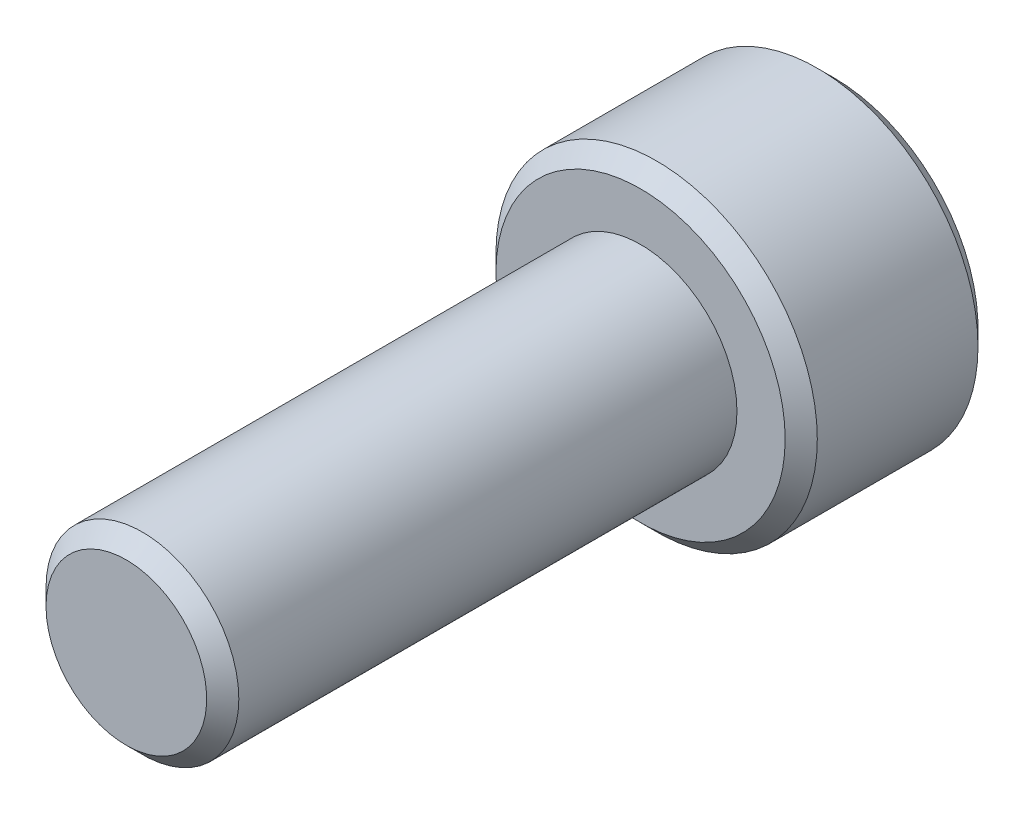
ISO-10303-21;
HEADER;
FILE_DESCRIPTION(('STEP AP214'),'2;1');
FILE_NAME('part.step','',(''),(''),'','','');
FILE_SCHEMA(('AUTOMOTIVE_DESIGN { 1 0 10303 214 1 1 1 1 }'));
ENDSEC;
DATA;
#1=APPLICATION_CONTEXT('core data for automotive mechanical design processes');
#2=APPLICATION_PROTOCOL_DEFINITION('international standard','automotive_design',2000,#1);
#3=PRODUCT_CONTEXT('',#1,'mechanical');
#4=PRODUCT('Part','Part','',(#3));
#5=PRODUCT_RELATED_PRODUCT_CATEGORY('part','',(#4));
#6=PRODUCT_DEFINITION_FORMATION('','',#4);
#7=PRODUCT_DEFINITION_CONTEXT('part definition',#1,'design');
#8=PRODUCT_DEFINITION('design','',#6,#7);
#9=PRODUCT_DEFINITION_SHAPE('','',#8);
#10=(LENGTH_UNIT() NAMED_UNIT(*) SI_UNIT(.MILLI.,.METRE.));
#11=(NAMED_UNIT(*) PLANE_ANGLE_UNIT() SI_UNIT($,.RADIAN.));
#12=(NAMED_UNIT(*) SI_UNIT($,.STERADIAN.) SOLID_ANGLE_UNIT());
#13=UNCERTAINTY_MEASURE_WITH_UNIT(LENGTH_MEASURE(1.E-05),#10,'distance_accuracy_value','');
#14=(GEOMETRIC_REPRESENTATION_CONTEXT(3) GLOBAL_UNCERTAINTY_ASSIGNED_CONTEXT((#13)) GLOBAL_UNIT_ASSIGNED_CONTEXT((#10,
#11,#12)) REPRESENTATION_CONTEXT('',''));
#15=CARTESIAN_POINT('',(0.,0.,0.));
#16=DIRECTION('',(0.,0.,1.));
#17=DIRECTION('',(1.,0.,0.));
#18=AXIS2_PLACEMENT_3D('',#15,#16,#17);
#19=CARTESIAN_POINT('',(-2.5,-1.443375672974,-22.25));
#20=DIRECTION('',(-1.,0.,0.));
#21=DIRECTION('',(0.,0.,1.));
#22=AXIS2_PLACEMENT_3D('',#19,#20,#21);
#23=PLANE('',#22);
#24=DIRECTION('',(0.,1.,0.));
#25=VECTOR('',#24,1.);
#26=CARTESIAN_POINT('',(-2.5,0.,-22.25));
#27=LINE('',#26,#25);
#28=CARTESIAN_POINT('',(-2.49999999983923,1.44337567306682,-22.25));
#29=VERTEX_POINT('',#28);
#30=CARTESIAN_POINT('',(-2.49999999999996,-1.44337567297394,-22.25));
#31=VERTEX_POINT('',#30);
#32=EDGE_CURVE('E172',#29,#31,#27,.F.);
#33=ORIENTED_EDGE('',*,*,#32,.T.);
#34=DIRECTION('',(0.,0.,1.));
#35=VECTOR('',#34,1.);
#36=CARTESIAN_POINT('',(-2.49999999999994,-1.4433756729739,-22.25));
#37=LINE('',#36,#35);
#38=CARTESIAN_POINT('',(-2.49999999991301,-1.44337567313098,-26.0000000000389));
#39=VERTEX_POINT('',#38);
#40=EDGE_CURVE('E274',#31,#39,#37,.F.);
#41=ORIENTED_EDGE('',*,*,#40,.T.);
#42=CARTESIAN_POINT('',(-2.5,1.44337567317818,-26.000000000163));
#43=CARTESIAN_POINT('',(-2.5,1.34480479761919,-25.9507605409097));
#44=CARTESIAN_POINT('',(-2.5,1.24459631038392,-25.904396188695));
#45=CARTESIAN_POINT('',(-2.5,1.04022304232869,-25.8194093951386));
#46=CARTESIAN_POINT('',(-2.5,0.936037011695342,-25.7808385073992));
#47=CARTESIAN_POINT('',(-2.5,0.724653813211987,-25.7142348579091));
#48=CARTESIAN_POINT('',(-2.5,0.617468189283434,-25.686166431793));
#49=CARTESIAN_POINT('',(-2.5,0.400747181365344,-25.642953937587));
#50=CARTESIAN_POINT('',(-2.5,0.29122015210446,-25.6277699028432));
#51=CARTESIAN_POINT('',(-2.5,0.151078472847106,-25.6176265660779));
#52=CARTESIAN_POINT('',(-2.5,0.120877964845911,-25.6159866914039));
#53=CARTESIAN_POINT('',(-2.5,0.0604529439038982,-25.6137976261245));
#54=CARTESIAN_POINT('',(-2.5,0.0302284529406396,-25.6132478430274));
#55=CARTESIAN_POINT('',(-2.5,-0.0758674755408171,-25.6132506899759));
#56=CARTESIAN_POINT('',(-2.5,-0.151759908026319,-25.616720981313));
#57=CARTESIAN_POINT('',(-2.5,-0.302963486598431,-25.6304110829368));
#58=CARTESIAN_POINT('',(-2.5,-0.378274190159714,-25.6406356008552));
#59=CARTESIAN_POINT('',(-2.5,-0.528122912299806,-25.6673531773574));
#60=CARTESIAN_POINT('',(-2.5,-0.602655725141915,-25.6838750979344));
#61=CARTESIAN_POINT('',(-2.5,-0.750290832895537,-25.7224353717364));
#62=CARTESIAN_POINT('',(-2.5,-0.823392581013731,-25.7444757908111));
#63=CARTESIAN_POINT('',(-2.5,-0.990079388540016,-25.8006905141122));
#64=CARTESIAN_POINT('',(-2.5,-1.08310139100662,-25.8365147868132));
#65=CARTESIAN_POINT('',(-2.5,-1.26562346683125,-25.9141573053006));
#66=CARTESIAN_POINT('',(-2.5,-1.35514797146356,-25.9559177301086));
#67=CARTESIAN_POINT('',(-2.5,-1.44337567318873,-26.0000000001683));
#68=B_SPLINE_CURVE_WITH_KNOTS('',3,(#42,#43,#44,#45,#46,#47,#48,#49,#50,#51,#52,#53,#54,#55,#56,
#57,#58,#59,#60,#61,#62,#63,#64,#65,#66,#67),.UNSPECIFIED.,.F.,.F.,(4,2,2,2,2,2,2,2,2,2,2,2,4),
(0.,0.330782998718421,0.663687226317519,0.995450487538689,1.32618083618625,1.41690228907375,
1.50757441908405,1.73514364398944,1.96287165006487,2.1916561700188,2.42052646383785,
2.71929868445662,3.01533818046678),.UNSPECIFIED.);
#69=CARTESIAN_POINT('',(-2.49999999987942,1.44337567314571,-26.0000000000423));
#70=VERTEX_POINT('',#69);
#71=EDGE_CURVE('E20',#70,#39,#68,.T.);
#72=ORIENTED_EDGE('',*,*,#71,.F.);
#73=DIRECTION('',(0.,0.,1.));
#74=VECTOR('',#73,1.);
#75=CARTESIAN_POINT('',(-2.49999999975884,1.44337567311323,-22.25));
#76=LINE('',#75,#74);
#77=EDGE_CURVE('E81',#70,#29,#76,.T.);
#78=ORIENTED_EDGE('',*,*,#77,.T.);
#79=EDGE_LOOP('',(#33,#41,#72,#78));
#80=FACE_BOUND('',#79,.T.);
#81=ADVANCED_FACE('F16',(#80),#23,.F.);
#82=CARTESIAN_POINT('',(2.5,1.443375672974,-22.25));
#83=DIRECTION('',(1.,0.,0.));
#84=DIRECTION('',(0.,0.,-1.));
#85=AXIS2_PLACEMENT_3D('',#82,#83,#84);
#86=PLANE('',#85);
#87=DIRECTION('',(0.,0.,1.));
#88=VECTOR('',#87,1.);
#89=CARTESIAN_POINT('',(2.49999999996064,-1.44337567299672,-22.25));
#90=LINE('',#89,#88);
#91=CARTESIAN_POINT('',(2.49999999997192,-1.44337567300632,-26.0000000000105));
#92=VERTEX_POINT('',#91);
#93=CARTESIAN_POINT('',(2.49999999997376,-1.44337567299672,-22.25));
#94=VERTEX_POINT('',#93);
#95=EDGE_CURVE('E272',#92,#94,#90,.T.);
#96=ORIENTED_EDGE('',*,*,#95,.T.);
#97=DIRECTION('',(0.,1.,0.));
#98=VECTOR('',#97,1.);
#99=CARTESIAN_POINT('',(2.5,0.,-22.25));
#100=LINE('',#99,#98);
#101=CARTESIAN_POINT('',(2.49999999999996,1.44337567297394,-22.25));
#102=VERTEX_POINT('',#101);
#103=EDGE_CURVE('E175',#94,#102,#100,.T.);
#104=ORIENTED_EDGE('',*,*,#103,.T.);
#105=DIRECTION('',(0.,0.,1.));
#106=VECTOR('',#105,1.);
#107=CARTESIAN_POINT('',(2.49999999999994,1.4433756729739,-22.25));
#108=LINE('',#107,#106);
#109=CARTESIAN_POINT('',(2.49999999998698,1.44337567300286,-26.0000000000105));
#110=VERTEX_POINT('',#109);
#111=EDGE_CURVE('E188',#102,#110,#108,.F.);
#112=ORIENTED_EDGE('',*,*,#111,.T.);
#113=CARTESIAN_POINT('',(2.5,-1.44337567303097,-25.9999999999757));
#114=CARTESIAN_POINT('',(2.5,-1.3448047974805,-25.9507605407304));
#115=CARTESIAN_POINT('',(2.5,-1.24459631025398,-25.9043961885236));
#116=CARTESIAN_POINT('',(2.5,-1.04022304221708,-25.8194093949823));
#117=CARTESIAN_POINT('',(2.5,-0.936037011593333,-25.78083850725));
#118=CARTESIAN_POINT('',(2.5,-0.724653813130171,-25.7142348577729));
#119=CARTESIAN_POINT('',(2.5,-0.617468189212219,-25.6861664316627));
#120=CARTESIAN_POINT('',(2.5,-0.400747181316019,-25.642953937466));
#121=CARTESIAN_POINT('',(2.5,-0.291220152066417,-25.6277699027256));
#122=CARTESIAN_POINT('',(2.5,-0.151078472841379,-25.6176265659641));
#123=CARTESIAN_POINT('',(2.5,-0.120877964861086,-25.6159866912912));
#124=CARTESIAN_POINT('',(2.5,-0.0604529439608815,-25.6137976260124));
#125=CARTESIAN_POINT('',(2.5,-0.0302284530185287,-25.613247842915));
#126=CARTESIAN_POINT('',(2.5,0.0758674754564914,-25.6132506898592));
#127=CARTESIAN_POINT('',(2.5,0.151759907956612,-25.6167209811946));
#128=CARTESIAN_POINT('',(2.5,0.302963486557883,-25.6304110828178));
#129=CARTESIAN_POINT('',(2.5,0.378274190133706,-25.6406356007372));
#130=CARTESIAN_POINT('',(2.5,0.528122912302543,-25.6673531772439));
#131=CARTESIAN_POINT('',(2.5,0.602655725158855,-25.6838750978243));
#132=CARTESIAN_POINT('',(2.5,0.750290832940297,-25.7224353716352));
#133=CARTESIAN_POINT('',(2.5,0.823392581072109,-25.7444757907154));
#134=CARTESIAN_POINT('',(2.5,0.990079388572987,-25.8006905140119));
#135=CARTESIAN_POINT('',(2.5,1.08310139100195,-25.8365147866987));
#136=CARTESIAN_POINT('',(2.5,1.2656234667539,-25.9141573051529));
#137=CARTESIAN_POINT('',(2.5,1.35514797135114,-25.9559177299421));
#138=CARTESIAN_POINT('',(2.5,1.44337567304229,-25.9999999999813));
#139=B_SPLINE_CURVE_WITH_KNOTS('',3,(#113,#114,#115,#116,#117,#118,#119,#120,#121,#122,#123,
#124,#125,#126,#127,#128,#129,#130,#131,#132,#133,#134,#135,#136,#137,#138),.UNSPECIFIED.,.F.,
.F.,(4,2,2,2,2,2,2,2,2,2,2,2,4),(0.,0.330782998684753,0.663687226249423,0.995450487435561,
1.32618083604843,1.41690228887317,1.50757441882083,1.73514364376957,1.96287164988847,
2.19165616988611,2.4205264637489,2.71929868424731,3.0153381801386),.UNSPECIFIED.);
#140=EDGE_CURVE('E40',#92,#110,#139,.T.);
#141=ORIENTED_EDGE('',*,*,#140,.F.);
#142=EDGE_LOOP('',(#96,#104,#112,#141));
#143=FACE_BOUND('',#142,.T.);
#144=ADVANCED_FACE('F164',(#143),#86,.F.);
#145=CARTESIAN_POINT('',(-5.,0.,-22.25));
#146=DIRECTION('',(0.,0.,1.));
#147=DIRECTION('',(1.,0.,0.));
#148=AXIS2_PLACEMENT_3D('',#145,#146,#147);
#149=PLANE('',#148);
#150=DIRECTION('',(0.866025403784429,0.500000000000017,0.));
#151=VECTOR('',#150,1.);
#152=CARTESIAN_POINT('',(2.5,-1.443375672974,-22.25));
#153=LINE('',#152,#151);
#154=CARTESIAN_POINT('',(0.,-2.88675134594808,-22.25));
#155=VERTEX_POINT('',#154);
#156=EDGE_CURVE('E269',#94,#155,#153,.F.);
#157=ORIENTED_EDGE('',*,*,#156,.T.);
#158=DIRECTION('',(0.866025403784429,-0.500000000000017,0.));
#159=VECTOR('',#158,1.);
#160=CARTESIAN_POINT('',(0.,-2.886751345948,-22.25));
#161=LINE('',#160,#159);
#162=EDGE_CURVE('E74',#155,#31,#161,.F.);
#163=ORIENTED_EDGE('',*,*,#162,.T.);
#164=ORIENTED_EDGE('',*,*,#32,.F.);
#165=DIRECTION('',(-0.866025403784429,-0.500000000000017,0.));
#166=VECTOR('',#165,1.);
#167=CARTESIAN_POINT('',(-2.5,1.443375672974,-22.25));
#168=LINE('',#167,#166);
#169=CARTESIAN_POINT('',(0.,2.88675134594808,-22.25));
#170=VERTEX_POINT('',#169);
#171=EDGE_CURVE('E75',#29,#170,#168,.F.);
#172=ORIENTED_EDGE('',*,*,#171,.T.);
#173=DIRECTION('',(-0.866025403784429,0.500000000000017,0.));
#174=VECTOR('',#173,1.);
#175=CARTESIAN_POINT('',(0.,2.886751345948,-22.25));
#176=LINE('',#175,#174);
#177=EDGE_CURVE('E71',#170,#102,#176,.F.);
#178=ORIENTED_EDGE('',*,*,#177,.T.);
#179=ORIENTED_EDGE('',*,*,#103,.F.);
#180=EDGE_LOOP('',(#157,#163,#164,#172,#178,#179));
#181=FACE_BOUND('',#180,.T.);
#182=ADVANCED_FACE('F162',(#181),#149,.F.);
#183=CARTESIAN_POINT('',(0.,2.886751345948,-22.25));
#184=DIRECTION('',(0.500000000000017,0.866025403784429,0.));
#185=DIRECTION('',(-0.866025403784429,0.500000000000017,0.));
#186=AXIS2_PLACEMENT_3D('',#183,#184,#185);
#187=PLANE('',#186);
#188=ORIENTED_EDGE('',*,*,#177,.F.);
#189=DIRECTION('',(0.,0.,1.));
#190=VECTOR('',#189,1.);
#191=CARTESIAN_POINT('',(0.,2.8867513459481,-22.25));
#192=LINE('',#191,#190);
#193=CARTESIAN_POINT('',(5.29757554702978E-13,2.88675134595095,-26.0000000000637));
#194=VERTEX_POINT('',#193);
#195=EDGE_CURVE('E62',#170,#194,#192,.F.);
#196=ORIENTED_EDGE('',*,*,#195,.T.);
#197=CARTESIAN_POINT('',(1.05953184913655E-12,2.88675134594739,-26.0000000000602));
#198=CARTESIAN_POINT('',(0.0859262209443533,2.83714181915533,-25.9504380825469));
#199=CARTESIAN_POINT('',(0.173289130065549,2.78670282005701,-25.9037875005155));
#200=CARTESIAN_POINT('',(0.351431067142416,2.68385252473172,-25.8183722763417));
#201=CARTESIAN_POINT('',(0.44222702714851,2.63143145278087,-25.7796551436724));
#202=CARTESIAN_POINT('',(0.625312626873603,2.52572693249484,-25.7133324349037));
#203=CARTESIAN_POINT('',(0.717555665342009,2.47247038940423,-25.6855602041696));
#204=CARTESIAN_POINT('',(0.904071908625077,2.36478518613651,-25.6427717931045));
#205=CARTESIAN_POINT('',(0.998339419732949,2.31035981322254,-25.6277236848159));
#206=CARTESIAN_POINT('',(1.16081381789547,2.21655517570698,-25.614146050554));
#207=CARTESIAN_POINT('',(1.228810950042,2.17729701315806,-25.6121367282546));
#208=CARTESIAN_POINT('',(1.36469396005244,2.09884492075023,-25.6155262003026));
#209=CARTESIAN_POINT('',(1.43257979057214,2.05965101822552,-25.6209275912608));
#210=CARTESIAN_POINT('',(1.56771033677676,1.98163336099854,-25.6388311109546));
#211=CARTESIAN_POINT('',(1.63495425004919,1.94281006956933,-25.6513411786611));
#212=CARTESIAN_POINT('',(1.76827922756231,1.86583485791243,-25.6827753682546));
#213=CARTESIAN_POINT('',(1.83436038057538,1.82768288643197,-25.7016989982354));
#214=CARTESIAN_POINT('',(2.00358309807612,1.72998210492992,-25.7578643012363));
#215=CARTESIAN_POINT('',(2.10567646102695,1.67103847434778,-25.7993349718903));
#216=CARTESIAN_POINT('',(2.25579690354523,1.58436639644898,-25.8693411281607));
#217=CARTESIAN_POINT('',(2.30526845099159,1.5558039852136,-25.8939377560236));
#218=CARTESIAN_POINT('',(2.40329553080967,1.49920802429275,-25.9453728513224));
#219=CARTESIAN_POINT('',(2.45185160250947,1.47117416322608,-25.9722099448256));
#220=CARTESIAN_POINT('',(2.49999999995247,1.44337567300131,-26.0000000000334));
#221=B_SPLINE_CURVE_WITH_KNOTS('',3,(#197,#198,#199,#200,#201,#202,#203,#204,#205,#206,#207,
#208,#209,#210,#211,#212,#213,#214,#215,#216,#217,#218,#219,#220),.UNSPECIFIED.,.F.,.F.,(4,2,2,
2,2,2,2,2,2,2,2,4),(0.,0.332957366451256,0.667853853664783,0.997433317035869,1.32618330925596,
1.56147590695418,1.79685096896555,2.03248941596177,2.26810979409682,2.64223182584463,
2.82878537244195,3.01522534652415),.UNSPECIFIED.);
#222=EDGE_CURVE('E67',#194,#110,#221,.T.);
#223=ORIENTED_EDGE('',*,*,#222,.T.);
#224=ORIENTED_EDGE('',*,*,#111,.F.);
#225=EDGE_LOOP('',(#188,#196,#223,#224));
#226=FACE_BOUND('',#225,.T.);
#227=ADVANCED_FACE('F64',(#226),#187,.F.);
#228=CARTESIAN_POINT('',(-2.5,1.443375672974,-22.25));
#229=DIRECTION('',(-0.500000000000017,0.866025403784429,0.));
#230=DIRECTION('',(-0.866025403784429,-0.500000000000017,0.));
#231=AXIS2_PLACEMENT_3D('',#228,#229,#230);
#232=PLANE('',#231);
#233=ORIENTED_EDGE('',*,*,#171,.F.);
#234=ORIENTED_EDGE('',*,*,#77,.F.);
#235=CARTESIAN_POINT('',(-2.49999999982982,1.44337567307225,-25.9999999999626));
#236=CARTESIAN_POINT('',(-2.4140737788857,1.49298519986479,-25.9504380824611));
#237=CARTESIAN_POINT('',(-2.32671086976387,1.54342419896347,-25.9037875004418));
#238=CARTESIAN_POINT('',(-2.14856893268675,1.64627449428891,-25.8183722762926));
#239=CARTESIAN_POINT('',(-2.05777297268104,1.69869556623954,-25.7796551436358));
#240=CARTESIAN_POINT('',(-1.87468737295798,1.8044000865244,-25.7133324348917));
#241=CARTESIAN_POINT('',(-1.78244433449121,1.85765662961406,-25.6855602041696));
#242=CARTESIAN_POINT('',(-1.5959280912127,1.96534183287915,-25.6427717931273));
#243=CARTESIAN_POINT('',(-1.50166058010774,2.01976720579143,-25.6277236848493));
#244=CARTESIAN_POINT('',(-1.33918618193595,2.11357184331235,-25.614146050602));
#245=CARTESIAN_POINT('',(-1.27118904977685,2.15283000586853,-25.6121367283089));
#246=CARTESIAN_POINT('',(-1.13530603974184,2.23128209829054,-25.615526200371));
#247=CARTESIAN_POINT('',(-1.06742020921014,2.27047600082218,-25.620927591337));
#248=CARTESIAN_POINT('',(-0.932289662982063,2.34849365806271,-25.6388311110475));
#249=CARTESIAN_POINT('',(-0.865045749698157,2.38731694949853,-25.6513411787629));
#250=CARTESIAN_POINT('',(-0.731720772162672,2.46429216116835,-25.6827753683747));
#251=CARTESIAN_POINT('',(-0.665639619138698,2.5024441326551,-25.7016989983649));
#252=CARTESIAN_POINT('',(-0.496416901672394,2.60014491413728,-25.7578643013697));
#253=CARTESIAN_POINT('',(-0.39432353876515,2.65908854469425,-25.7993349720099));
#254=CARTESIAN_POINT('',(-0.244203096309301,2.74576062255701,-25.8693411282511));
#255=CARTESIAN_POINT('',(-0.194731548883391,2.77432303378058,-25.8939377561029));
#256=CARTESIAN_POINT('',(-0.0967044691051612,2.83091899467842,-25.9453728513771));
#257=CARTESIAN_POINT('',(-0.0481483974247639,2.85895285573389,-25.9722099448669));
#258=CARTESIAN_POINT('',(-7.59519550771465E-13,2.88675134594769,-26.0000000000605));
#259=B_SPLINE_CURVE_WITH_KNOTS('',3,(#235,#236,#237,#238,#239,#240,#241,#242,#243,#244,#245,
#246,#247,#248,#249,#250,#251,#252,#253,#254,#255,#256,#257,#258),.UNSPECIFIED.,.F.,.F.,(4,2,2,
2,2,2,2,2,2,2,2,4),(0.,0.332957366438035,0.667853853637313,0.997433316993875,1.32618330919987,
1.56147590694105,1.79685096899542,2.03248941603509,2.26810979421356,2.64223182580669,
2.82878537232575,3.01522534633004),.UNSPECIFIED.);
#260=EDGE_CURVE('E79',#70,#194,#259,.T.);
#261=ORIENTED_EDGE('',*,*,#260,.T.);
#262=ORIENTED_EDGE('',*,*,#195,.F.);
#263=EDGE_LOOP('',(#233,#234,#261,#262));
#264=FACE_BOUND('',#263,.T.);
#265=ADVANCED_FACE('F80',(#264),#232,.F.);
#266=CARTESIAN_POINT('',(0.,-2.886751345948,-22.25));
#267=DIRECTION('',(-0.500000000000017,-0.866025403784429,0.));
#268=DIRECTION('',(0.866025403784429,-0.500000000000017,0.));
#269=AXIS2_PLACEMENT_3D('',#266,#267,#268);
#270=PLANE('',#269);
#271=ORIENTED_EDGE('',*,*,#162,.F.);
#272=DIRECTION('',(0.,0.,1.));
#273=VECTOR('',#272,1.);
#274=CARTESIAN_POINT('',(0.,-2.8867513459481,-22.25));
#275=LINE('',#274,#273);
#276=CARTESIAN_POINT('',(2.46370472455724E-12,-2.88675134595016,-26.000000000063));
#277=VERTEX_POINT('',#276);
#278=EDGE_CURVE('E91',#155,#277,#275,.F.);
#279=ORIENTED_EDGE('',*,*,#278,.T.);
#280=CARTESIAN_POINT('',(-3.10393232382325E-12,-2.88675134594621,-26.000000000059));
#281=CARTESIAN_POINT('',(-0.0859262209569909,-2.83714181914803,-25.9504380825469));
#282=CARTESIAN_POINT('',(-0.173289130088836,-2.78670282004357,-25.9037875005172));
#283=CARTESIAN_POINT('',(-0.351431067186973,-2.68385252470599,-25.8183722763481));
#284=CARTESIAN_POINT('',(-0.442227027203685,-2.63143145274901,-25.7796551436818));
#285=CARTESIAN_POINT('',(-0.625312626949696,-2.5257269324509,-25.7133324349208));
#286=CARTESIAN_POINT('',(-0.717555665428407,-2.47247038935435,-25.6855602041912));
#287=CARTESIAN_POINT('',(-0.904071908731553,-2.36478518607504,-25.6427717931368));
#288=CARTESIAN_POINT('',(-0.998339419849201,-2.31035981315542,-25.6277236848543));
#289=CARTESIAN_POINT('',(-1.16081381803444,-2.21655517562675,-25.6141460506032));
#290=CARTESIAN_POINT('',(-1.22881095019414,-2.17729701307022,-25.6121367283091));
#291=CARTESIAN_POINT('',(-1.36469396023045,-2.09884492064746,-25.6155262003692));
#292=CARTESIAN_POINT('',(-1.43257979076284,-2.05965101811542,-25.6209275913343));
#293=CARTESIAN_POINT('',(-1.56771033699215,-1.98163336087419,-25.6388311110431));
#294=CARTESIAN_POINT('',(-1.63495425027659,-1.94281006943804,-25.6513411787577));
#295=CARTESIAN_POINT('',(-1.76827922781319,-1.86583485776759,-25.682775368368));
#296=CARTESIAN_POINT('',(-1.83436038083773,-1.8276828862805,-25.7016989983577));
#297=CARTESIAN_POINT('',(-2.00358309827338,-1.72998210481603,-25.7578643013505));
#298=CARTESIAN_POINT('',(-2.10567646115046,-1.67103847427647,-25.7993349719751));
#299=CARTESIAN_POINT('',(-2.25579690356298,-1.58436639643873,-25.8693411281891));
#300=CARTESIAN_POINT('',(-2.30526845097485,-1.55580398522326,-25.8939377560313));
#301=CARTESIAN_POINT('',(-2.40329553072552,-1.49920802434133,-25.9453728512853));
#302=CARTESIAN_POINT('',(-2.4518516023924,-1.47117416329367,-25.9722099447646));
#303=CARTESIAN_POINT('',(-2.49999999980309,-1.44337567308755,-25.9999999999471));
#304=B_SPLINE_CURVE_WITH_KNOTS('',3,(#280,#281,#282,#283,#284,#285,#286,#287,#288,#289,#290,
#291,#292,#293,#294,#295,#296,#297,#298,#299,#300,#301,#302,#303),.UNSPECIFIED.,.F.,.F.,(4,2,2,
2,2,2,2,2,2,2,2,4),(0.,0.332957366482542,0.667853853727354,0.997433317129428,1.32618330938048,
1.56147590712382,1.79685096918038,2.03248941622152,2.26810979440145,2.64223182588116,
2.82878537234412,3.0152253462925),.UNSPECIFIED.);
#305=EDGE_CURVE('E85',#277,#39,#304,.T.);
#306=ORIENTED_EDGE('',*,*,#305,.T.);
#307=ORIENTED_EDGE('',*,*,#40,.F.);
#308=EDGE_LOOP('',(#271,#279,#306,#307));
#309=FACE_BOUND('',#308,.T.);
#310=ADVANCED_FACE('F157',(#309),#270,.F.);
#311=CARTESIAN_POINT('',(2.5,-1.443375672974,-22.25));
#312=DIRECTION('',(0.500000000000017,-0.866025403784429,0.));
#313=DIRECTION('',(0.866025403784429,0.500000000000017,0.));
#314=AXIS2_PLACEMENT_3D('',#311,#312,#313);
#315=PLANE('',#314);
#316=ORIENTED_EDGE('',*,*,#156,.F.);
#317=ORIENTED_EDGE('',*,*,#95,.F.);
#318=CARTESIAN_POINT('',(2.49999999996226,-1.44337567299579,-26.0000000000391));
#319=CARTESIAN_POINT('',(2.41407377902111,-1.49298519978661,-25.9504380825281));
#320=CARTESIAN_POINT('',(2.32671086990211,-1.54342419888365,-25.903787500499));
#321=CARTESIAN_POINT('',(2.14856893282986,-1.64627449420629,-25.8183722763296));
#322=CARTESIAN_POINT('',(2.05777297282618,-1.69869556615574,-25.7796551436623));
#323=CARTESIAN_POINT('',(1.87468737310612,-1.80440008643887,-25.7133324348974));
#324=CARTESIAN_POINT('',(1.78244433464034,-1.85765662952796,-25.6855602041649));
#325=CARTESIAN_POINT('',(1.59592809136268,-1.96534183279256,-25.6427717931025));
#326=CARTESIAN_POINT('',(1.5016605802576,-2.01976720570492,-25.6277236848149));
#327=CARTESIAN_POINT('',(1.33918618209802,-2.11357184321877,-25.6141460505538));
#328=CARTESIAN_POINT('',(1.27118904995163,-2.15283000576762,-25.6121367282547));
#329=CARTESIAN_POINT('',(1.13530603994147,-2.23128209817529,-25.6155262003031));
#330=CARTESIAN_POINT('',(1.06742020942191,-2.27047600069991,-25.6209275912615));
#331=CARTESIAN_POINT('',(0.932289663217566,-2.34849365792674,-25.6388311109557));
#332=CARTESIAN_POINT('',(0.865045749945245,-2.38731694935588,-25.6513411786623));
#333=CARTESIAN_POINT('',(0.731720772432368,-2.46429216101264,-25.6827753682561));
#334=CARTESIAN_POINT('',(0.665639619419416,-2.50244413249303,-25.7016989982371));
#335=CARTESIAN_POINT('',(0.496416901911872,-2.60014491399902,-25.7578643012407));
#336=CARTESIAN_POINT('',(0.394323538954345,-2.65908854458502,-25.7993349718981));
#337=CARTESIAN_POINT('',(0.244203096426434,-2.74576062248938,-25.8693411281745));
#338=CARTESIAN_POINT('',(0.194731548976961,-2.77432303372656,-25.8939377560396));
#339=CARTESIAN_POINT('',(0.0967044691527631,-2.83091899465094,-25.9453728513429));
#340=CARTESIAN_POINT('',(0.048148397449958,-2.85895285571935,-25.9722099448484));
#341=CARTESIAN_POINT('',(3.9981934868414E-12,-2.88675134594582,-26.0000000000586));
#342=B_SPLINE_CURVE_WITH_KNOTS('',3,(#318,#319,#320,#321,#322,#323,#324,#325,#326,#327,#328,
#329,#330,#331,#332,#333,#334,#335,#336,#337,#338,#339,#340,#341),.UNSPECIFIED.,.F.,.F.,(4,2,2,
2,2,2,2,2,2,2,2,4),(0.,0.332957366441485,0.667853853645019,0.997433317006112,1.32618330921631,
1.56147590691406,1.79685096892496,2.03248941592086,2.2681097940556,2.6422318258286,
2.82878537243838,3.01522534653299),.UNSPECIFIED.);
#343=EDGE_CURVE('E105',#92,#277,#342,.T.);
#344=ORIENTED_EDGE('',*,*,#343,.T.);
#345=ORIENTED_EDGE('',*,*,#278,.F.);
#346=EDGE_LOOP('',(#316,#317,#344,#345));
#347=FACE_BOUND('',#346,.T.);
#348=ADVANCED_FACE('F123',(#347),#315,.F.);
#349=CARTESIAN_POINT('',(0.,0.,-25.9999999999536));
#350=DIRECTION('',(0.,0.,-1.));
#351=DIRECTION('',(-1.,0.,0.));
#352=AXIS2_PLACEMENT_3D('',#349,#350,#351);
#353=CONICAL_SURFACE('',#352,2.88675134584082,0.785398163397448);
#354=ORIENTED_EDGE('',*,*,#222,.F.);
#355=CARTESIAN_POINT('',(0.,0.,-26.0000000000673));
#356=DIRECTION('',(0.,0.,-1.));
#357=DIRECTION('',(-1.,0.,0.));
#358=AXIS2_PLACEMENT_3D('',#355,#356,#357);
#359=CIRCLE('',#358,2.88675134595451);
#360=EDGE_CURVE('E90',#110,#194,#359,.F.);
#361=ORIENTED_EDGE('',*,*,#360,.F.);
#362=EDGE_LOOP('',(#354,#361));
#363=FACE_BOUND('',#362,.T.);
#364=ADVANCED_FACE('F88',(#363),#353,.F.);
#365=CARTESIAN_POINT('',(0.,0.,-25.9999999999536));
#366=DIRECTION('',(0.,0.,-1.));
#367=DIRECTION('',(-1.,0.,0.));
#368=AXIS2_PLACEMENT_3D('',#365,#366,#367);
#369=CONICAL_SURFACE('',#368,2.88675134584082,0.785398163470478);
#370=ORIENTED_EDGE('',*,*,#260,.F.);
#371=CARTESIAN_POINT('',(0.,0.,-26.0000000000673));
#372=DIRECTION('',(0.,0.,-1.));
#373=DIRECTION('',(-1.,0.,0.));
#374=AXIS2_PLACEMENT_3D('',#371,#372,#373);
#375=CIRCLE('',#374,2.88675134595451);
#376=EDGE_CURVE('E93',#194,#70,#375,.F.);
#377=ORIENTED_EDGE('',*,*,#376,.F.);
#378=EDGE_LOOP('',(#370,#377));
#379=FACE_BOUND('',#378,.T.);
#380=ADVANCED_FACE('F94',(#379),#369,.F.);
#381=CARTESIAN_POINT('',(0.,0.,-26.000000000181));
#382=DIRECTION('',(0.,0.,-1.));
#383=DIRECTION('',(-1.,0.,0.));
#384=AXIS2_PLACEMENT_3D('',#381,#382,#383);
#385=CONICAL_SURFACE('',#384,2.88675134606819,0.785398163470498);
#386=CARTESIAN_POINT('',(0.,0.,-26.0000000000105));
#387=DIRECTION('',(0.,0.,-1.));
#388=DIRECTION('',(-1.,0.,0.));
#389=AXIS2_PLACEMENT_3D('',#386,#387,#388);
#390=CIRCLE('',#389,2.88675134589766);
#391=EDGE_CURVE('E97',#70,#39,#390,.F.);
#392=ORIENTED_EDGE('',*,*,#391,.F.);
#393=ORIENTED_EDGE('',*,*,#71,.T.);
#394=EDGE_LOOP('',(#392,#393));
#395=FACE_BOUND('',#394,.T.);
#396=ADVANCED_FACE('F137',(#395),#385,.F.);
#397=CARTESIAN_POINT('',(0.,0.,-25.9999999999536));
#398=DIRECTION('',(0.,0.,-1.));
#399=DIRECTION('',(-1.,0.,0.));
#400=AXIS2_PLACEMENT_3D('',#397,#398,#399);
#401=CONICAL_SURFACE('',#400,2.88675134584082,0.785398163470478);
#402=ORIENTED_EDGE('',*,*,#305,.F.);
#403=CARTESIAN_POINT('',(0.,0.,-26.0000000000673));
#404=DIRECTION('',(0.,0.,-1.));
#405=DIRECTION('',(-1.,0.,0.));
#406=AXIS2_PLACEMENT_3D('',#403,#404,#405);
#407=CIRCLE('',#406,2.88675134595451);
#408=EDGE_CURVE('E209',#39,#277,#407,.F.);
#409=ORIENTED_EDGE('',*,*,#408,.F.);
#410=EDGE_LOOP('',(#402,#409));
#411=FACE_BOUND('',#410,.T.);
#412=ADVANCED_FACE('F131',(#411),#401,.F.);
#413=CARTESIAN_POINT('',(0.,0.,-25.9999999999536));
#414=DIRECTION('',(0.,0.,-1.));
#415=DIRECTION('',(-1.,0.,0.));
#416=AXIS2_PLACEMENT_3D('',#413,#414,#415);
#417=CONICAL_SURFACE('',#416,2.88675134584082,0.785398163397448);
#418=ORIENTED_EDGE('',*,*,#343,.F.);
#419=CARTESIAN_POINT('',(0.,0.,-26.0000000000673));
#420=DIRECTION('',(0.,0.,-1.));
#421=DIRECTION('',(-1.,0.,0.));
#422=AXIS2_PLACEMENT_3D('',#419,#420,#421);
#423=CIRCLE('',#422,2.88675134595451);
#424=EDGE_CURVE('E207',#277,#92,#423,.F.);
#425=ORIENTED_EDGE('',*,*,#424,.F.);
#426=EDGE_LOOP('',(#418,#425));
#427=FACE_BOUND('',#426,.T.);
#428=ADVANCED_FACE('F126',(#427),#417,.F.);
#429=CARTESIAN_POINT('',(0.,0.,-25.9999999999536));
#430=DIRECTION('',(0.,0.,-1.));
#431=DIRECTION('',(-1.,0.,0.));
#432=AXIS2_PLACEMENT_3D('',#429,#430,#431);
#433=CONICAL_SURFACE('',#432,2.88675134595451,0.785398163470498);
#434=ORIENTED_EDGE('',*,*,#140,.T.);
#435=CARTESIAN_POINT('',(0.,0.,-25.9999999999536));
#436=DIRECTION('',(0.,0.,-1.));
#437=DIRECTION('',(-1.,0.,0.));
#438=AXIS2_PLACEMENT_3D('',#435,#436,#437);
#439=CIRCLE('',#438,2.88675134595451);
#440=EDGE_CURVE('E104',#92,#110,#439,.F.);
#441=ORIENTED_EDGE('',*,*,#440,.F.);
#442=EDGE_LOOP('',(#434,#441));
#443=FACE_BOUND('',#442,.T.);
#444=ADVANCED_FACE('F130',(#443),#433,.F.);
#445=CARTESIAN_POINT('',(0.,0.,-26.));
#446=DIRECTION('',(0.,0.,-1.));
#447=DIRECTION('',(-1.,0.,0.));
#448=AXIS2_PLACEMENT_3D('',#445,#446,#447);
#449=PLANE('',#448);
#450=ORIENTED_EDGE('',*,*,#424,.T.);
#451=ORIENTED_EDGE('',*,*,#440,.T.);
#452=ORIENTED_EDGE('',*,*,#360,.T.);
#453=ORIENTED_EDGE('',*,*,#376,.T.);
#454=ORIENTED_EDGE('',*,*,#391,.T.);
#455=ORIENTED_EDGE('',*,*,#408,.T.);
#456=EDGE_LOOP('',(#450,#451,#452,#453,#454,#455));
#457=FACE_BOUND('',#456,.T.);
#458=CARTESIAN_POINT('',(0.,0.,-26.0000000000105));
#459=DIRECTION('',(0.,0.,1.));
#460=DIRECTION('',(0.,-1.,0.));
#461=AXIS2_PLACEMENT_3D('',#458,#459,#460);
#462=CIRCLE('',#461,4.50000000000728);
#463=CARTESIAN_POINT('',(0.,-4.50000000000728,-26.0000000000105));
#464=VERTEX_POINT('',#463);
#465=EDGE_CURVE('E202',#464,#464,#462,.T.);
#466=ORIENTED_EDGE('',*,*,#465,.F.);
#467=EDGE_LOOP('',(#466));
#468=FACE_BOUND('',#467,.T.);
#469=ADVANCED_FACE('F101',(#457,#468),#449,.T.);
#470=CARTESIAN_POINT('',(0.,0.,-25.500000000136));
#471=DIRECTION('',(0.,0.,1.));
#472=DIRECTION('',(0.,-1.,0.));
#473=AXIS2_PLACEMENT_3D('',#470,#471,#472);
#474=CONICAL_SURFACE('',#473,4.99999999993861,0.785398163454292);
#475=CARTESIAN_POINT('',(0.,0.,-25.5));
#476=DIRECTION('',(0.,0.,1.));
#477=DIRECTION('',(1.,0.,0.));
#478=AXIS2_PLACEMENT_3D('',#475,#476,#477);
#479=CIRCLE('',#478,5.);
#480=CARTESIAN_POINT('',(5.,0.,-25.5));
#481=VERTEX_POINT('',#480);
#482=EDGE_CURVE('E205',#481,#481,#479,.T.);
#483=ORIENTED_EDGE('',*,*,#482,.F.);
#484=EDGE_LOOP('',(#483));
#485=FACE_BOUND('',#484,.T.);
#486=ORIENTED_EDGE('',*,*,#465,.T.);
#487=EDGE_LOOP('',(#486));
#488=FACE_BOUND('',#487,.T.);
#489=ADVANCED_FACE('F225',(#485,#488),#474,.T.);
#490=CARTESIAN_POINT('',(0.,0.,-26.));
#491=DIRECTION('',(0.,0.,1.));
#492=DIRECTION('',(1.,0.,0.));
#493=AXIS2_PLACEMENT_3D('',#490,#491,#492);
#494=CYLINDRICAL_SURFACE('',#493,5.);
#495=CARTESIAN_POINT('',(0.,0.,-20.5000000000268));
#496=DIRECTION('',(0.,0.,-1.));
#497=DIRECTION('',(-1.,0.,0.));
#498=AXIS2_PLACEMENT_3D('',#495,#496,#497);
#499=CIRCLE('',#498,4.99999999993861);
#500=CARTESIAN_POINT('',(-4.99999999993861,0.,-20.5000000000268));
#501=VERTEX_POINT('',#500);
#502=EDGE_CURVE('E201',#501,#501,#499,.F.);
#503=ORIENTED_EDGE('',*,*,#502,.F.);
#504=EDGE_LOOP('',(#503));
#505=FACE_BOUND('',#504,.T.);
#506=ORIENTED_EDGE('',*,*,#482,.T.);
#507=EDGE_LOOP('',(#506));
#508=FACE_BOUND('',#507,.T.);
#509=ADVANCED_FACE('F249',(#505,#508),#494,.T.);
#510=CARTESIAN_POINT('',(0.,0.,-4.000000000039));
#511=DIRECTION('',(0.,0.,1.));
#512=DIRECTION('',(1.,0.,0.));
#513=AXIS2_PLACEMENT_3D('',#510,#511,#512);
#514=PLANE('',#513);
#515=CARTESIAN_POINT('',(0.,0.,-3.99999999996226));
#516=DIRECTION('',(0.,0.,-1.));
#517=DIRECTION('',(-1.,0.,0.));
#518=AXIS2_PLACEMENT_3D('',#515,#516,#517);
#519=CIRCLE('',#518,2.50000000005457);
#520=CARTESIAN_POINT('',(-2.50000000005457,0.,-3.99999999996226));
#521=VERTEX_POINT('',#520);
#522=EDGE_CURVE('E198',#521,#521,#519,.T.);
#523=ORIENTED_EDGE('',*,*,#522,.F.);
#524=EDGE_LOOP('',(#523));
#525=FACE_BOUND('',#524,.T.);
#526=ADVANCED_FACE('F245',(#525),#514,.T.);
#527=CARTESIAN_POINT('',(0.,0.,-20.49999999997));
#528=DIRECTION('',(0.,0.,-1.));
#529=DIRECTION('',(-1.,0.,0.));
#530=AXIS2_PLACEMENT_3D('',#527,#528,#529);
#531=CONICAL_SURFACE('',#530,4.99999999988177,0.785398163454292);
#532=ORIENTED_EDGE('',*,*,#502,.T.);
#533=EDGE_LOOP('',(#532));
#534=FACE_BOUND('',#533,.T.);
#535=CARTESIAN_POINT('',(0.,0.,-20.0000000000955));
#536=DIRECTION('',(0.,0.,-1.));
#537=DIRECTION('',(-1.,0.,0.));
#538=AXIS2_PLACEMENT_3D('',#535,#536,#537);
#539=CIRCLE('',#538,4.49999999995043);
#540=CARTESIAN_POINT('',(-4.49999999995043,0.,-20.0000000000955));
#541=VERTEX_POINT('',#540);
#542=EDGE_CURVE('E195',#541,#541,#539,.F.);
#543=ORIENTED_EDGE('',*,*,#542,.F.);
#544=EDGE_LOOP('',(#543));
#545=FACE_BOUND('',#544,.T.);
#546=ADVANCED_FACE('F241',(#534,#545),#531,.T.);
#547=CARTESIAN_POINT('',(0.,0.,-4.50000000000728));
#548=DIRECTION('',(0.,0.,-1.));
#549=DIRECTION('',(-1.,0.,0.));
#550=AXIS2_PLACEMENT_3D('',#547,#548,#549);
#551=CONICAL_SURFACE('',#550,3.00000000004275,0.785398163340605);
#552=CARTESIAN_POINT('',(0.,0.,-4.500000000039));
#553=DIRECTION('',(0.,0.,-1.));
#554=DIRECTION('',(-1.,0.,0.));
#555=AXIS2_PLACEMENT_3D('',#552,#553,#554);
#556=CIRCLE('',#555,3.);
#557=CARTESIAN_POINT('',(-3.,0.,-4.500000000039));
#558=VERTEX_POINT('',#557);
#559=EDGE_CURVE('E31',#558,#558,#556,.T.);
#560=ORIENTED_EDGE('',*,*,#559,.F.);
#561=EDGE_LOOP('',(#560));
#562=FACE_BOUND('',#561,.T.);
#563=ORIENTED_EDGE('',*,*,#522,.T.);
#564=EDGE_LOOP('',(#563));
#565=FACE_BOUND('',#564,.T.);
#566=ADVANCED_FACE('F234',(#562,#565),#551,.T.);
#567=CARTESIAN_POINT('',(-4.49999999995,0.,-20.00000000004));
#568=DIRECTION('',(0.,0.,1.));
#569=DIRECTION('',(1.,0.,0.));
#570=AXIS2_PLACEMENT_3D('',#567,#568,#569);
#571=PLANE('',#570);
#572=CARTESIAN_POINT('',(0.,0.,-20.00000000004));
#573=DIRECTION('',(0.,0.,-1.));
#574=DIRECTION('',(-1.,0.,0.));
#575=AXIS2_PLACEMENT_3D('',#572,#573,#574);
#576=CIRCLE('',#575,3.);
#577=CARTESIAN_POINT('',(-3.,0.,-20.00000000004));
#578=VERTEX_POINT('',#577);
#579=EDGE_CURVE('E11',#578,#578,#576,.F.);
#580=ORIENTED_EDGE('',*,*,#579,.F.);
#581=EDGE_LOOP('',(#580));
#582=FACE_BOUND('',#581,.T.);
#583=ORIENTED_EDGE('',*,*,#542,.T.);
#584=EDGE_LOOP('',(#583));
#585=FACE_BOUND('',#584,.T.);
#586=ADVANCED_FACE('F228',(#582,#585),#571,.T.);
#587=CARTESIAN_POINT('',(0.,0.,-4.000000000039));
#588=DIRECTION('',(0.,0.,-1.));
#589=DIRECTION('',(-1.,0.,0.));
#590=AXIS2_PLACEMENT_3D('',#587,#588,#589);
#591=CYLINDRICAL_SURFACE('',#590,3.);
#592=ORIENTED_EDGE('',*,*,#579,.T.);
#593=EDGE_LOOP('',(#592));
#594=FACE_BOUND('',#593,.T.);
#595=ORIENTED_EDGE('',*,*,#559,.T.);
#596=EDGE_LOOP('',(#595));
#597=FACE_BOUND('',#596,.T.);
#598=ADVANCED_FACE('F226',(#594,#597),#591,.T.);
#599=CLOSED_SHELL('',(#81,#144,#182,#227,#265,#310,#348,#364,#380,#396,#412,#428,#444,#469,#489,
#509,#526,#546,#566,#586,#598));
#600=MANIFOLD_SOLID_BREP('B1',#599);
#601=ADVANCED_BREP_SHAPE_REPRESENTATION('',(#18,#600),#14);
#602=SHAPE_DEFINITION_REPRESENTATION(#9,#601);
ENDSEC;
END-ISO-10303-21;
